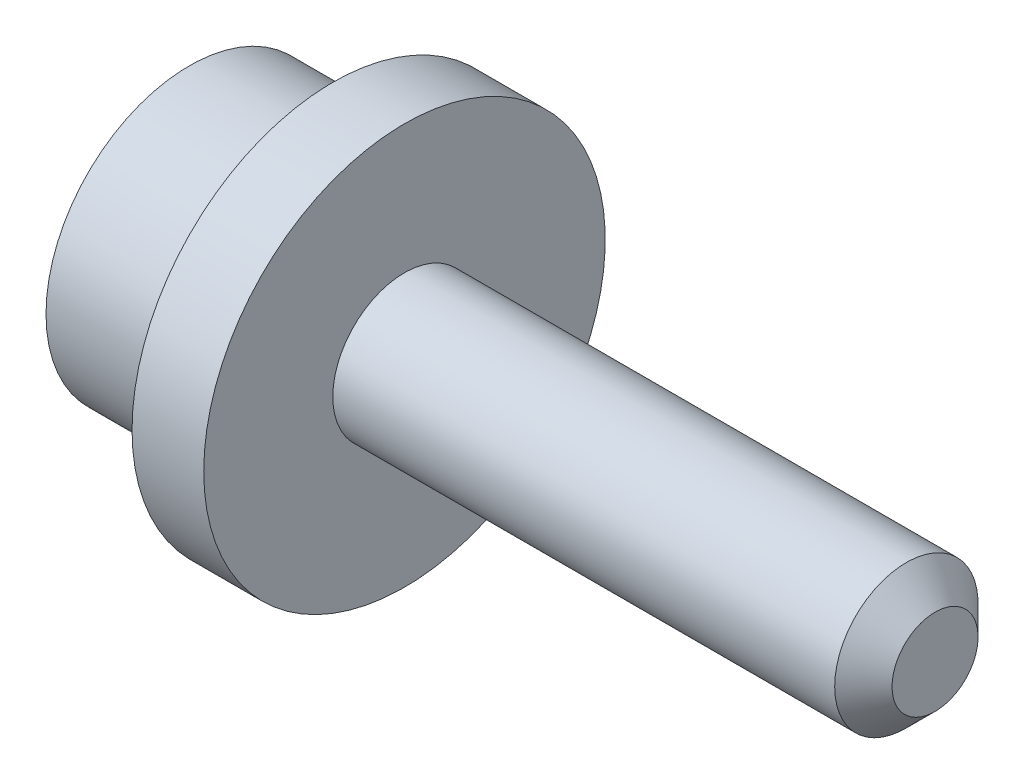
ISO-10303-21;
HEADER;
FILE_DESCRIPTION(('STEP AP214'),'2;1');
FILE_NAME('part.step','',(''),(''),'','','');
FILE_SCHEMA(('AUTOMOTIVE_DESIGN { 1 0 10303 214 1 1 1 1 }'));
ENDSEC;
DATA;
#1=APPLICATION_CONTEXT('core data for automotive mechanical design processes');
#2=APPLICATION_PROTOCOL_DEFINITION('international standard','automotive_design',2000,#1);
#3=PRODUCT_CONTEXT('',#1,'mechanical');
#4=PRODUCT('Part','Part','',(#3));
#5=PRODUCT_RELATED_PRODUCT_CATEGORY('part','',(#4));
#6=PRODUCT_DEFINITION_FORMATION('','',#4);
#7=PRODUCT_DEFINITION_CONTEXT('part definition',#1,'design');
#8=PRODUCT_DEFINITION('design','',#6,#7);
#9=PRODUCT_DEFINITION_SHAPE('','',#8);
#10=(LENGTH_UNIT() NAMED_UNIT(*) SI_UNIT(.MILLI.,.METRE.));
#11=(NAMED_UNIT(*) PLANE_ANGLE_UNIT() SI_UNIT($,.RADIAN.));
#12=(NAMED_UNIT(*) SI_UNIT($,.STERADIAN.) SOLID_ANGLE_UNIT());
#13=UNCERTAINTY_MEASURE_WITH_UNIT(LENGTH_MEASURE(1.E-05),#10,'distance_accuracy_value','');
#14=(GEOMETRIC_REPRESENTATION_CONTEXT(3) GLOBAL_UNCERTAINTY_ASSIGNED_CONTEXT((#13)) GLOBAL_UNIT_ASSIGNED_CONTEXT((#10,
#11,#12)) REPRESENTATION_CONTEXT('',''));
#15=CARTESIAN_POINT('',(0.,0.,0.));
#16=DIRECTION('',(0.,0.,1.));
#17=DIRECTION('',(1.,0.,0.));
#18=AXIS2_PLACEMENT_3D('',#15,#16,#17);
#19=CARTESIAN_POINT('',(0.,5.,0.));
#20=DIRECTION('',(1.,0.,0.));
#21=DIRECTION('',(0.,0.,-1.));
#22=AXIS2_PLACEMENT_3D('',#19,#20,#21);
#23=PLANE('',#22);
#24=CARTESIAN_POINT('',(0.,0.,0.));
#25=DIRECTION('',(-1.,0.,0.));
#26=DIRECTION('',(0.,0.,1.));
#27=AXIS2_PLACEMENT_3D('',#24,#25,#26);
#28=CIRCLE('',#27,1.5);
#29=CARTESIAN_POINT('',(0.,0.,1.5));
#30=VERTEX_POINT('',#29);
#31=EDGE_CURVE('E41',#30,#30,#28,.T.);
#32=ORIENTED_EDGE('',*,*,#31,.F.);
#33=EDGE_LOOP('',(#32));
#34=FACE_BOUND('',#33,.T.);
#35=CARTESIAN_POINT('',(0.,0.,0.));
#36=DIRECTION('',(-1.,0.,0.));
#37=DIRECTION('',(0.,0.,1.));
#38=AXIS2_PLACEMENT_3D('',#35,#36,#37);
#39=CIRCLE('',#38,5.);
#40=CARTESIAN_POINT('',(0.,0.,5.));
#41=VERTEX_POINT('',#40);
#42=EDGE_CURVE('E62',#41,#41,#39,.T.);
#43=ORIENTED_EDGE('',*,*,#42,.T.);
#44=EDGE_LOOP('',(#43));
#45=FACE_BOUND('',#44,.T.);
#46=ADVANCED_FACE('F30',(#34,#45),#23,.F.);
#47=CARTESIAN_POINT('',(-19.1631703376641,0.,0.));
#48=DIRECTION('',(-1.,0.,0.));
#49=DIRECTION('',(0.,0.,1.));
#50=AXIS2_PLACEMENT_3D('',#47,#48,#49);
#51=CYLINDRICAL_SURFACE('',#50,1.5);
#52=CARTESIAN_POINT('',(15.,0.,0.));
#53=DIRECTION('',(-1.,0.,0.));
#54=DIRECTION('',(0.,0.,1.));
#55=AXIS2_PLACEMENT_3D('',#52,#53,#54);
#56=CIRCLE('',#55,1.5);
#57=CARTESIAN_POINT('',(15.,0.,1.5));
#58=VERTEX_POINT('',#57);
#59=EDGE_CURVE('E45',#58,#58,#56,.T.);
#60=ORIENTED_EDGE('',*,*,#59,.F.);
#61=EDGE_LOOP('',(#60));
#62=FACE_BOUND('',#61,.T.);
#63=ORIENTED_EDGE('',*,*,#31,.T.);
#64=EDGE_LOOP('',(#63));
#65=FACE_BOUND('',#64,.T.);
#66=ADVANCED_FACE('F101',(#62,#65),#51,.F.);
#67=CARTESIAN_POINT('',(15.,1.5,0.));
#68=DIRECTION('',(1.,0.,0.));
#69=DIRECTION('',(0.,0.,-1.));
#70=AXIS2_PLACEMENT_3D('',#67,#68,#69);
#71=PLANE('',#70);
#72=ORIENTED_EDGE('',*,*,#59,.T.);
#73=EDGE_LOOP('',(#72));
#74=FACE_BOUND('',#73,.T.);
#75=ADVANCED_FACE('F98',(#74),#71,.F.);
#76=CARTESIAN_POINT('',(26.,0.,0.));
#77=DIRECTION('',(-1.,0.,0.));
#78=DIRECTION('',(0.,0.,1.));
#79=AXIS2_PLACEMENT_3D('',#76,#77,#78);
#80=PLANE('',#79);
#81=CARTESIAN_POINT('',(26.,0.,0.));
#82=DIRECTION('',(-1.,0.,0.));
#83=DIRECTION('',(0.,0.,1.));
#84=AXIS2_PLACEMENT_3D('',#81,#82,#83);
#85=CIRCLE('',#84,1.50000000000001);
#86=CARTESIAN_POINT('',(26.,0.,1.50000000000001));
#87=VERTEX_POINT('',#86);
#88=EDGE_CURVE('E10',#87,#87,#85,.F.);
#89=ORIENTED_EDGE('',*,*,#88,.T.);
#90=EDGE_LOOP('',(#89));
#91=FACE_BOUND('',#90,.T.);
#92=ADVANCED_FACE('F93',(#91),#80,.F.);
#93=CARTESIAN_POINT('',(-19.1631703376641,0.,0.));
#94=DIRECTION('',(-1.,0.,0.));
#95=DIRECTION('',(0.,0.,1.));
#96=AXIS2_PLACEMENT_3D('',#93,#94,#95);
#97=CYLINDRICAL_SURFACE('',#96,2.5);
#98=CARTESIAN_POINT('',(25.,0.,0.));
#99=DIRECTION('',(-1.,0.,0.));
#100=DIRECTION('',(0.,0.,1.));
#101=AXIS2_PLACEMENT_3D('',#98,#99,#100);
#102=CIRCLE('',#101,2.5);
#103=CARTESIAN_POINT('',(25.,0.,2.5));
#104=VERTEX_POINT('',#103);
#105=EDGE_CURVE('E37',#104,#104,#102,.T.);
#106=ORIENTED_EDGE('',*,*,#105,.T.);
#107=EDGE_LOOP('',(#106));
#108=FACE_BOUND('',#107,.T.);
#109=CARTESIAN_POINT('',(7.5,0.,0.));
#110=DIRECTION('',(-1.,0.,0.));
#111=DIRECTION('',(0.,0.,1.));
#112=AXIS2_PLACEMENT_3D('',#109,#110,#111);
#113=CIRCLE('',#112,2.5);
#114=CARTESIAN_POINT('',(7.5,0.,2.5));
#115=VERTEX_POINT('',#114);
#116=EDGE_CURVE('E50',#115,#115,#113,.T.);
#117=ORIENTED_EDGE('',*,*,#116,.F.);
#118=EDGE_LOOP('',(#117));
#119=FACE_BOUND('',#118,.T.);
#120=ADVANCED_FACE('F88',(#108,#119),#97,.T.);
#121=CARTESIAN_POINT('',(7.5,2.5,0.));
#122=DIRECTION('',(-1.,0.,0.));
#123=DIRECTION('',(0.,0.,1.));
#124=AXIS2_PLACEMENT_3D('',#121,#122,#123);
#125=PLANE('',#124);
#126=CARTESIAN_POINT('',(7.5,0.,0.));
#127=DIRECTION('',(-1.,0.,0.));
#128=DIRECTION('',(0.,0.,1.));
#129=AXIS2_PLACEMENT_3D('',#126,#127,#128);
#130=CIRCLE('',#129,7.);
#131=CARTESIAN_POINT('',(7.5,0.,7.));
#132=VERTEX_POINT('',#131);
#133=EDGE_CURVE('E53',#132,#132,#130,.T.);
#134=ORIENTED_EDGE('',*,*,#133,.F.);
#135=EDGE_LOOP('',(#134));
#136=FACE_BOUND('',#135,.T.);
#137=ORIENTED_EDGE('',*,*,#116,.T.);
#138=EDGE_LOOP('',(#137));
#139=FACE_BOUND('',#138,.T.);
#140=ADVANCED_FACE('F82',(#136,#139),#125,.F.);
#141=CARTESIAN_POINT('',(-19.1631703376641,0.,0.));
#142=DIRECTION('',(-1.,0.,0.));
#143=DIRECTION('',(0.,0.,1.));
#144=AXIS2_PLACEMENT_3D('',#141,#142,#143);
#145=CYLINDRICAL_SURFACE('',#144,7.);
#146=CARTESIAN_POINT('',(5.,0.,0.));
#147=DIRECTION('',(-1.,0.,0.));
#148=DIRECTION('',(0.,0.,1.));
#149=AXIS2_PLACEMENT_3D('',#146,#147,#148);
#150=CIRCLE('',#149,7.);
#151=CARTESIAN_POINT('',(5.,0.,7.));
#152=VERTEX_POINT('',#151);
#153=EDGE_CURVE('E56',#152,#152,#150,.T.);
#154=ORIENTED_EDGE('',*,*,#153,.F.);
#155=EDGE_LOOP('',(#154));
#156=FACE_BOUND('',#155,.T.);
#157=ORIENTED_EDGE('',*,*,#133,.T.);
#158=EDGE_LOOP('',(#157));
#159=FACE_BOUND('',#158,.T.);
#160=ADVANCED_FACE('F76',(#156,#159),#145,.T.);
#161=CARTESIAN_POINT('',(5.,7.,0.));
#162=DIRECTION('',(1.,0.,0.));
#163=DIRECTION('',(0.,0.,-1.));
#164=AXIS2_PLACEMENT_3D('',#161,#162,#163);
#165=PLANE('',#164);
#166=CARTESIAN_POINT('',(5.,0.,0.));
#167=DIRECTION('',(-1.,0.,0.));
#168=DIRECTION('',(0.,0.,1.));
#169=AXIS2_PLACEMENT_3D('',#166,#167,#168);
#170=CIRCLE('',#169,5.);
#171=CARTESIAN_POINT('',(5.,0.,5.));
#172=VERTEX_POINT('',#171);
#173=EDGE_CURVE('E59',#172,#172,#170,.T.);
#174=ORIENTED_EDGE('',*,*,#173,.F.);
#175=EDGE_LOOP('',(#174));
#176=FACE_BOUND('',#175,.T.);
#177=ORIENTED_EDGE('',*,*,#153,.T.);
#178=EDGE_LOOP('',(#177));
#179=FACE_BOUND('',#178,.T.);
#180=ADVANCED_FACE('F70',(#176,#179),#165,.F.);
#181=CARTESIAN_POINT('',(-19.1631703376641,0.,0.));
#182=DIRECTION('',(-1.,0.,0.));
#183=DIRECTION('',(0.,0.,1.));
#184=AXIS2_PLACEMENT_3D('',#181,#182,#183);
#185=CYLINDRICAL_SURFACE('',#184,5.);
#186=ORIENTED_EDGE('',*,*,#42,.F.);
#187=EDGE_LOOP('',(#186));
#188=FACE_BOUND('',#187,.T.);
#189=ORIENTED_EDGE('',*,*,#173,.T.);
#190=EDGE_LOOP('',(#189));
#191=FACE_BOUND('',#190,.T.);
#192=ADVANCED_FACE('F67',(#188,#191),#185,.T.);
#193=CARTESIAN_POINT('',(25.,0.,0.));
#194=DIRECTION('',(-1.,0.,0.));
#195=DIRECTION('',(0.,0.,1.));
#196=AXIS2_PLACEMENT_3D('',#193,#194,#195);
#197=CONICAL_SURFACE('',#196,2.5,0.785398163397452);
#198=ORIENTED_EDGE('',*,*,#88,.F.);
#199=EDGE_LOOP('',(#198));
#200=FACE_BOUND('',#199,.T.);
#201=ORIENTED_EDGE('',*,*,#105,.F.);
#202=EDGE_LOOP('',(#201));
#203=FACE_BOUND('',#202,.T.);
#204=ADVANCED_FACE('F32',(#200,#203),#197,.T.);
#205=CLOSED_SHELL('',(#46,#66,#75,#92,#120,#140,#160,#180,#192,#204));
#206=MANIFOLD_SOLID_BREP('B2',#205);
#207=ADVANCED_BREP_SHAPE_REPRESENTATION('',(#18,#206),#14);
#208=SHAPE_DEFINITION_REPRESENTATION(#9,#207);
ENDSEC;
END-ISO-10303-21;
